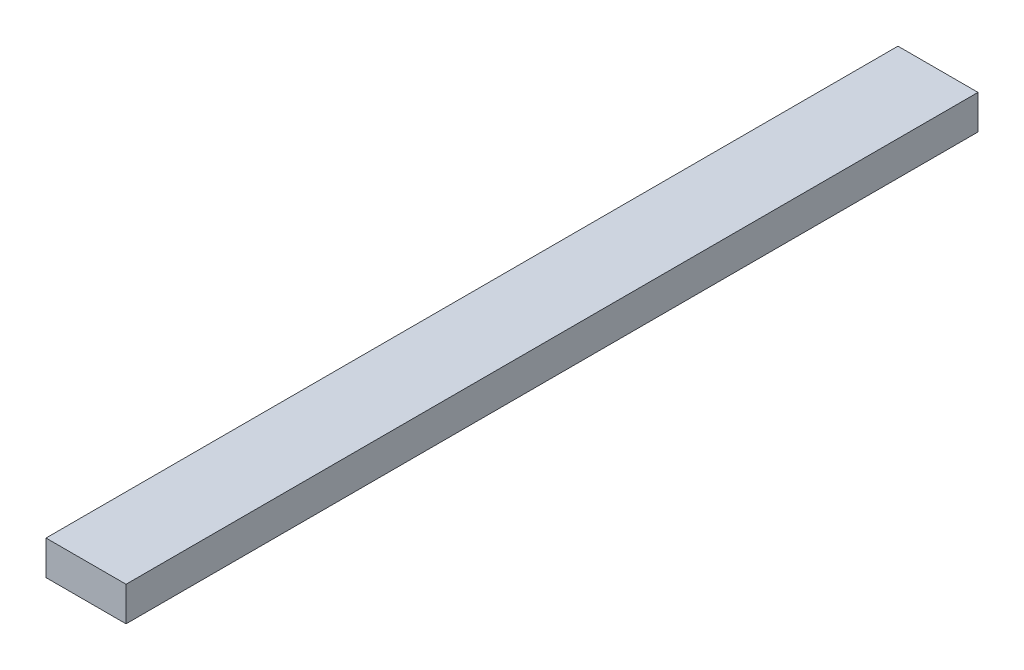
from build123d import *

# Parameters (mm, degrees)
SKETCH1_W           = 88.9
SKETCH1_H           = 946.15
BOSS_EXTRUDE1_DEPTH = 38.1


with BuildPart() as part:
    # Sketch1 → Boss-Extrude1 (new body)
    with BuildSketch(Plane(origin=(0, 0, 0), x_dir=(1, 0, 0), z_dir=(0, 1, 0))):
        Rectangle(SKETCH1_W, SKETCH1_H)
    extrude(amount=BOSS_EXTRUDE1_DEPTH)


solid = part.part
